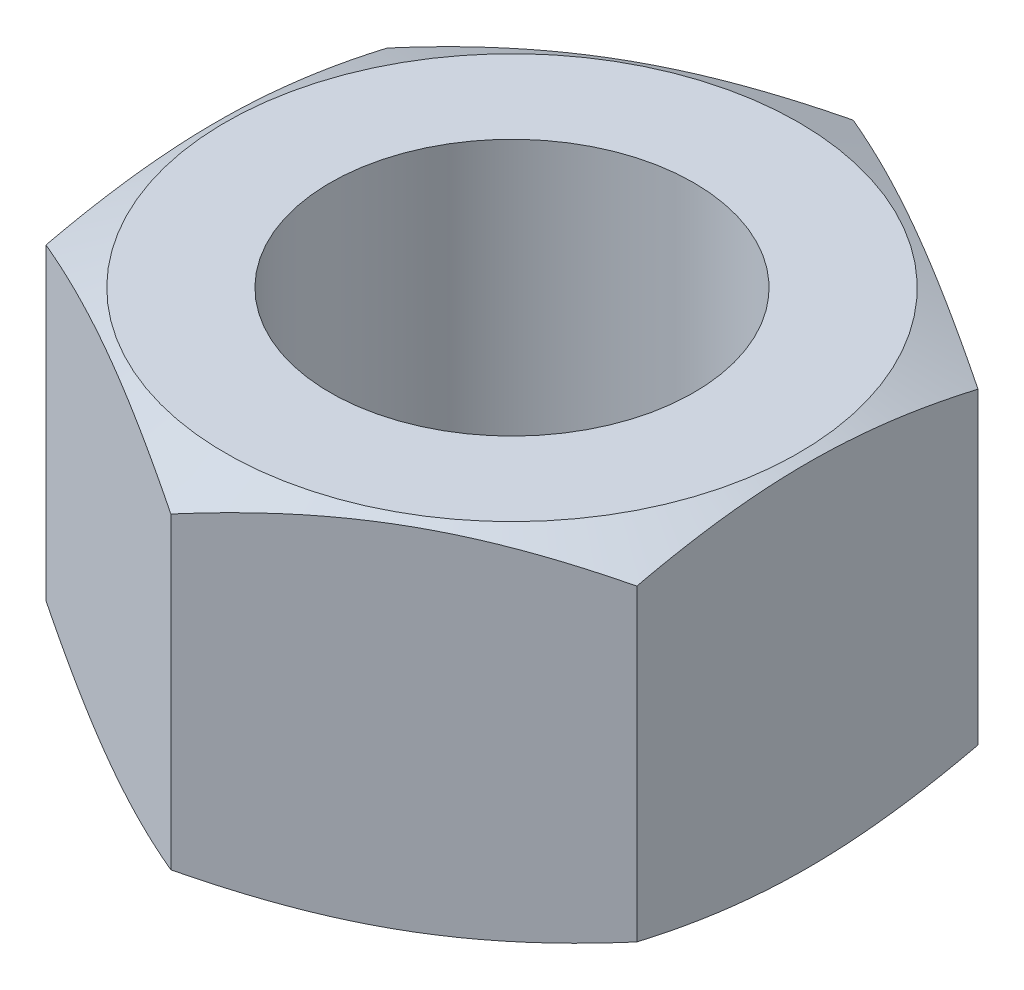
from build123d import *

# Parameters (mm, degrees)
ESQUISSE2_W             = 16.512217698
ESQUISSE2_H             = 16.512217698
ENL_V_MAT_EXTRU_1_DEPTH = 7.9


with BuildPart() as part:
    # Esquisse1 → Base-R_volution (revolve)
    with BuildSketch(Plane.XY, mode=Mode.PRIVATE) as base_r_volution_sk:
        Polygon((4, 0), (4, 7.9), (6.30466494, 7.9), (7.505553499, 7.340016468), (7.505553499, 0.559983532), (6.30466494, 0), align=None)
    revolve(base_r_volution_sk.sketch.rotate(Axis((0, -79, 0), (0, 1, 0)), 90), axis=Axis((0, -79, 0), (0, 1, 0)))

    # Esquisse2 → Enl_v. mat.-Extru.1 (cut)
    with BuildSketch(Plane(origin=(0, 0, 0), x_dir=(1, 0, 0), z_dir=(0, 1, 0))):
        Rectangle(ESQUISSE2_W, ESQUISSE2_H)
        Polygon((6.5, 3.75277675), (0, 7.505553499), (-6.5, 3.75277675), (-6.5, -3.75277675), (0, -7.505553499), (6.5, -3.75277675), align=None, mode=Mode.SUBTRACT)
    extrude(amount=ENL_V_MAT_EXTRU_1_DEPTH, mode=Mode.SUBTRACT)


solid = part.part
